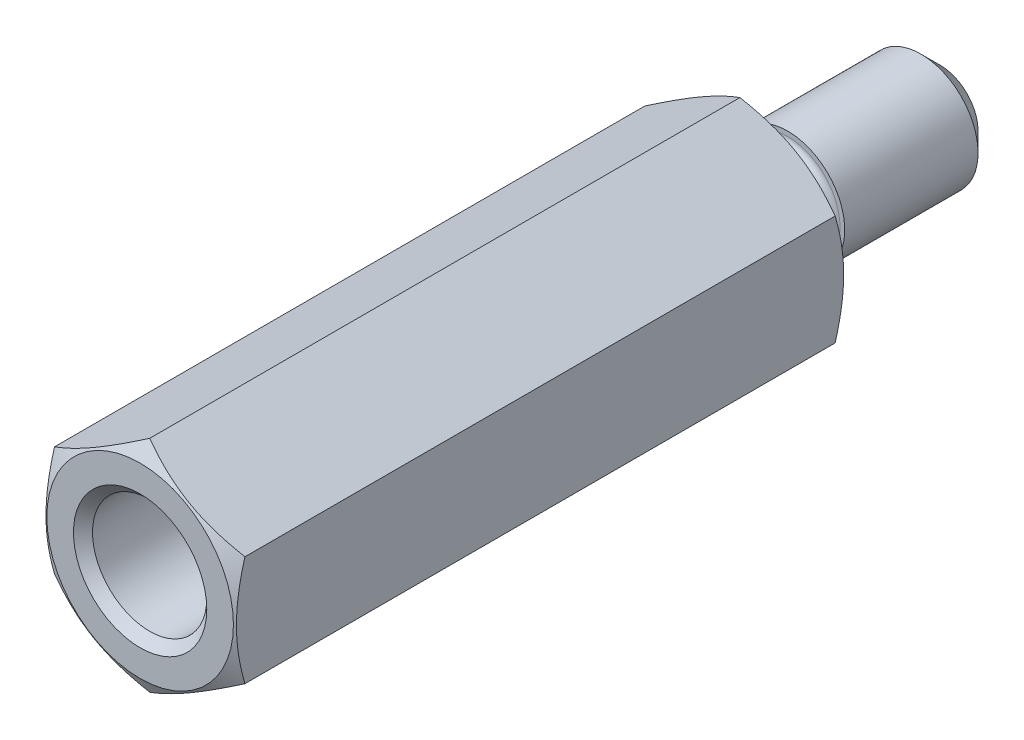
ISO-10303-21;
HEADER;
FILE_DESCRIPTION(('STEP AP214'),'2;1');
FILE_NAME('part.step','',(''),(''),'','','');
FILE_SCHEMA(('AUTOMOTIVE_DESIGN { 1 0 10303 214 1 1 1 1 }'));
ENDSEC;
DATA;
#1=APPLICATION_CONTEXT('core data for automotive mechanical design processes');
#2=APPLICATION_PROTOCOL_DEFINITION('international standard','automotive_design',2000,#1);
#3=PRODUCT_CONTEXT('',#1,'mechanical');
#4=PRODUCT('Part','Part','',(#3));
#5=PRODUCT_RELATED_PRODUCT_CATEGORY('part','',(#4));
#6=PRODUCT_DEFINITION_FORMATION('','',#4);
#7=PRODUCT_DEFINITION_CONTEXT('part definition',#1,'design');
#8=PRODUCT_DEFINITION('design','',#6,#7);
#9=PRODUCT_DEFINITION_SHAPE('','',#8);
#10=(LENGTH_UNIT() NAMED_UNIT(*) SI_UNIT(.MILLI.,.METRE.));
#11=(NAMED_UNIT(*) PLANE_ANGLE_UNIT() SI_UNIT($,.RADIAN.));
#12=(NAMED_UNIT(*) SI_UNIT($,.STERADIAN.) SOLID_ANGLE_UNIT());
#13=UNCERTAINTY_MEASURE_WITH_UNIT(LENGTH_MEASURE(1.E-05),#10,'distance_accuracy_value','');
#14=(GEOMETRIC_REPRESENTATION_CONTEXT(3) GLOBAL_UNCERTAINTY_ASSIGNED_CONTEXT((#13)) GLOBAL_UNIT_ASSIGNED_CONTEXT((#10,
#11,#12)) REPRESENTATION_CONTEXT('',''));
#15=CARTESIAN_POINT('',(0.,0.,0.));
#16=DIRECTION('',(0.,0.,1.));
#17=DIRECTION('',(1.,0.,0.));
#18=AXIS2_PLACEMENT_3D('',#15,#16,#17);
#19=CARTESIAN_POINT('',(0.,-5.77350269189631,0.));
#20=DIRECTION('',(0.,0.,-1.));
#21=DIRECTION('',(-1.,0.,0.));
#22=AXIS2_PLACEMENT_3D('',#19,#20,#21);
#23=PLANE('',#22);
#24=CARTESIAN_POINT('',(0.,0.,0.));
#25=DIRECTION('',(0.,0.,-1.));
#26=DIRECTION('',(-1.,0.,0.));
#27=AXIS2_PLACEMENT_3D('',#24,#25,#26);
#28=CIRCLE('',#27,2.75);
#29=CARTESIAN_POINT('',(-2.75,0.,0.));
#30=VERTEX_POINT('',#29);
#31=EDGE_CURVE('E23',#30,#30,#28,.F.);
#32=ORIENTED_EDGE('',*,*,#31,.T.);
#33=EDGE_LOOP('',(#32));
#34=FACE_BOUND('',#33,.T.);
#35=CARTESIAN_POINT('',(0.,0.,0.));
#36=DIRECTION('',(0.,0.,-1.));
#37=DIRECTION('',(-1.,0.,0.));
#38=AXIS2_PLACEMENT_3D('',#35,#36,#37);
#39=CIRCLE('',#38,4.9);
#40=CARTESIAN_POINT('',(-4.9,0.,0.));
#41=VERTEX_POINT('',#40);
#42=EDGE_CURVE('E73',#41,#41,#39,.T.);
#43=ORIENTED_EDGE('',*,*,#42,.T.);
#44=EDGE_LOOP('',(#43));
#45=FACE_BOUND('',#44,.T.);
#46=ADVANCED_FACE('F14',(#34,#45),#23,.T.);
#47=CARTESIAN_POINT('',(0.,0.,-10.));
#48=DIRECTION('',(0.,0.,1.));
#49=DIRECTION('',(1.,0.,0.));
#50=AXIS2_PLACEMENT_3D('',#47,#48,#49);
#51=CYLINDRICAL_SURFACE('',#50,3.);
#52=CARTESIAN_POINT('',(0.,0.,-2.));
#53=DIRECTION('',(0.,0.,-1.));
#54=DIRECTION('',(-1.,0.,0.));
#55=AXIS2_PLACEMENT_3D('',#52,#53,#54);
#56=CIRCLE('',#55,3.);
#57=CARTESIAN_POINT('',(-3.,0.,-2.));
#58=VERTEX_POINT('',#57);
#59=EDGE_CURVE('E233',#58,#58,#56,.T.);
#60=ORIENTED_EDGE('',*,*,#59,.T.);
#61=EDGE_LOOP('',(#60));
#62=FACE_BOUND('',#61,.T.);
#63=CARTESIAN_POINT('',(0.,0.,-9.));
#64=DIRECTION('',(0.,0.,-1.));
#65=DIRECTION('',(-1.,0.,0.));
#66=AXIS2_PLACEMENT_3D('',#63,#64,#65);
#67=CIRCLE('',#66,3.);
#68=CARTESIAN_POINT('',(-3.,0.,-9.));
#69=VERTEX_POINT('',#68);
#70=EDGE_CURVE('E85',#69,#69,#67,.F.);
#71=ORIENTED_EDGE('',*,*,#70,.T.);
#72=EDGE_LOOP('',(#71));
#73=FACE_BOUND('',#72,.T.);
#74=ADVANCED_FACE('F209',(#62,#73),#51,.T.);
#75=CARTESIAN_POINT('',(0.,0.,-10.));
#76=DIRECTION('',(0.,0.,-1.));
#77=DIRECTION('',(-1.,0.,0.));
#78=AXIS2_PLACEMENT_3D('',#75,#76,#77);
#79=PLANE('',#78);
#80=CARTESIAN_POINT('',(0.,0.,-10.));
#81=DIRECTION('',(0.,0.,-1.));
#82=DIRECTION('',(-1.,0.,0.));
#83=AXIS2_PLACEMENT_3D('',#80,#81,#82);
#84=CIRCLE('',#83,2.);
#85=CARTESIAN_POINT('',(-2.,0.,-10.));
#86=VERTEX_POINT('',#85);
#87=EDGE_CURVE('E82',#86,#86,#84,.T.);
#88=ORIENTED_EDGE('',*,*,#87,.T.);
#89=EDGE_LOOP('',(#88));
#90=FACE_BOUND('',#89,.T.);
#91=ADVANCED_FACE('F213',(#90),#79,.T.);
#92=CARTESIAN_POINT('',(0.,0.,-10.));
#93=DIRECTION('',(0.,0.,1.));
#94=DIRECTION('',(1.,0.,0.));
#95=AXIS2_PLACEMENT_3D('',#92,#93,#94);
#96=CONICAL_SURFACE('',#95,2.,0.785398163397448);
#97=ORIENTED_EDGE('',*,*,#70,.F.);
#98=EDGE_LOOP('',(#97));
#99=FACE_BOUND('',#98,.T.);
#100=ORIENTED_EDGE('',*,*,#87,.F.);
#101=EDGE_LOOP('',(#100));
#102=FACE_BOUND('',#101,.T.);
#103=ADVANCED_FACE('F216',(#99,#102),#96,.T.);
#104=CARTESIAN_POINT('',(0.,0.,-2.));
#105=DIRECTION('',(0.,0.,-1.));
#106=DIRECTION('',(-1.,0.,0.));
#107=AXIS2_PLACEMENT_3D('',#104,#105,#106);
#108=PLANE('',#107);
#109=CARTESIAN_POINT('',(0.,0.,-2.));
#110=DIRECTION('',(0.,0.,-1.));
#111=DIRECTION('',(-1.,0.,0.));
#112=AXIS2_PLACEMENT_3D('',#109,#110,#111);
#113=CIRCLE('',#112,2.75);
#114=CARTESIAN_POINT('',(-2.75,0.,-2.));
#115=VERTEX_POINT('',#114);
#116=EDGE_CURVE('E93',#115,#115,#113,.T.);
#117=ORIENTED_EDGE('',*,*,#116,.T.);
#118=EDGE_LOOP('',(#117));
#119=FACE_BOUND('',#118,.T.);
#120=ORIENTED_EDGE('',*,*,#59,.F.);
#121=EDGE_LOOP('',(#120));
#122=FACE_BOUND('',#121,.T.);
#123=ADVANCED_FACE('F218',(#119,#122),#108,.F.);
#124=CARTESIAN_POINT('',(0.,0.,-2.));
#125=DIRECTION('',(0.,0.,1.));
#126=DIRECTION('',(1.,0.,0.));
#127=AXIS2_PLACEMENT_3D('',#124,#125,#126);
#128=CYLINDRICAL_SURFACE('',#127,2.35);
#129=CARTESIAN_POINT('',(0.,0.,-1.6));
#130=DIRECTION('',(0.,0.,-1.));
#131=DIRECTION('',(-1.,0.,0.));
#132=AXIS2_PLACEMENT_3D('',#129,#130,#131);
#133=CIRCLE('',#132,2.35);
#134=CARTESIAN_POINT('',(-2.35,0.,-1.6));
#135=VERTEX_POINT('',#134);
#136=EDGE_CURVE('E99',#135,#135,#133,.F.);
#137=ORIENTED_EDGE('',*,*,#136,.T.);
#138=EDGE_LOOP('',(#137));
#139=FACE_BOUND('',#138,.T.);
#140=CARTESIAN_POINT('',(0.,0.,-0.4));
#141=DIRECTION('',(0.,0.,-1.));
#142=DIRECTION('',(-1.,0.,0.));
#143=AXIS2_PLACEMENT_3D('',#140,#141,#142);
#144=CIRCLE('',#143,2.35);
#145=CARTESIAN_POINT('',(-2.35,0.,-0.4));
#146=VERTEX_POINT('',#145);
#147=EDGE_CURVE('E96',#146,#146,#144,.T.);
#148=ORIENTED_EDGE('',*,*,#147,.T.);
#149=EDGE_LOOP('',(#148));
#150=FACE_BOUND('',#149,.T.);
#151=ADVANCED_FACE('F121',(#139,#150),#128,.T.);
#152=CARTESIAN_POINT('',(0.,0.,-1.6));
#153=DIRECTION('',(0.,0.,-1.));
#154=DIRECTION('',(-1.,0.,0.));
#155=AXIS2_PLACEMENT_3D('',#152,#153,#154);
#156=TOROIDAL_SURFACE('',#155,2.75,0.4);
#157=ORIENTED_EDGE('',*,*,#136,.F.);
#158=EDGE_LOOP('',(#157));
#159=FACE_BOUND('',#158,.T.);
#160=ORIENTED_EDGE('',*,*,#116,.F.);
#161=EDGE_LOOP('',(#160));
#162=FACE_BOUND('',#161,.T.);
#163=ADVANCED_FACE('F226',(#159,#162),#156,.F.);
#164=CARTESIAN_POINT('',(0.,0.,-0.4));
#165=DIRECTION('',(0.,0.,-1.));
#166=DIRECTION('',(-1.,0.,0.));
#167=AXIS2_PLACEMENT_3D('',#164,#165,#166);
#168=TOROIDAL_SURFACE('',#167,2.75,0.4);
#169=ORIENTED_EDGE('',*,*,#31,.F.);
#170=EDGE_LOOP('',(#169));
#171=FACE_BOUND('',#170,.T.);
#172=ORIENTED_EDGE('',*,*,#147,.F.);
#173=EDGE_LOOP('',(#172));
#174=FACE_BOUND('',#173,.T.);
#175=ADVANCED_FACE('F16',(#171,#174),#168,.F.);
#176=CARTESIAN_POINT('',(0.,0.,0.));
#177=DIRECTION('',(0.,0.,1.));
#178=DIRECTION('',(-1.,0.,0.));
#179=AXIS2_PLACEMENT_3D('',#176,#177,#178);
#180=CONICAL_SURFACE('',#179,4.9,1.0471975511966);
#181=ORIENTED_EDGE('',*,*,#42,.F.);
#182=EDGE_LOOP('',(#181));
#183=FACE_BOUND('',#182,.T.);
#184=CARTESIAN_POINT('',(5.,-28.4243501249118,13.8337533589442));
#185=CARTESIAN_POINT('',(4.99999999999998,-27.537544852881,13.3295392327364));
#186=CARTESIAN_POINT('',(4.99999999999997,-26.6504677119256,12.825801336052));
#187=CARTESIAN_POINT('',(4.99999999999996,-24.8744835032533,11.8191944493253));
#188=CARTESIAN_POINT('',(4.99999999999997,-23.9855755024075,11.3163271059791));
#189=CARTESIAN_POINT('',(4.99999999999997,-22.1863571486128,10.3010709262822));
#190=CARTESIAN_POINT('',(4.99999999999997,-21.2760215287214,9.78872684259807));
#191=CARTESIAN_POINT('',(4.99999999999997,-19.4547568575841,8.76753594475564));
#192=CARTESIAN_POINT('',(4.99999999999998,-18.5438296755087,8.25868580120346));
#193=CARTESIAN_POINT('',(4.99999999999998,-17.0037481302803,7.40325740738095));
#194=CARTESIAN_POINT('',(4.99999999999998,-16.3752376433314,7.05552084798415));
#195=CARTESIAN_POINT('',(4.99999999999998,-15.1166280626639,6.36293820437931));
#196=CARTESIAN_POINT('',(4.99999999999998,-14.4865289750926,6.01809210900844));
#197=CARTESIAN_POINT('',(4.99999999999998,-13.2215425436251,5.33110139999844));
#198=CARTESIAN_POINT('',(4.99999999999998,-12.5866461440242,4.98897341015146));
#199=CARTESIAN_POINT('',(4.99999999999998,-11.6319360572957,4.48049903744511));
#200=CARTESIAN_POINT('',(4.99999999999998,-11.3133630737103,4.31182399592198));
#201=CARTESIAN_POINT('',(4.99999999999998,-10.6751911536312,3.97642742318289));
#202=CARTESIAN_POINT('',(4.99999999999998,-10.3555922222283,3.809705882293));
#203=CARTESIAN_POINT('',(4.99999999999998,-9.72072526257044,3.48163105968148));
#204=CARTESIAN_POINT('',(4.99999999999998,-9.40547942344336,3.32023489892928));
#205=CARTESIAN_POINT('',(4.99999999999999,-8.77342887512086,3.00050127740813));
#206=CARTESIAN_POINT('',(4.99999999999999,-8.45662413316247,2.84216388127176));
#207=CARTESIAN_POINT('',(4.99999999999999,-7.82055467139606,2.52925722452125));
#208=CARTESIAN_POINT('',(4.99999999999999,-7.5012869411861,2.37469406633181));
#209=CARTESIAN_POINT('',(4.99999999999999,-6.86021433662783,2.07094785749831));
#210=CARTESIAN_POINT('',(4.99999999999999,-6.53840961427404,1.92176448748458));
#211=CARTESIAN_POINT('',(4.99999999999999,-5.8938983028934,1.63183101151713));
#212=CARTESIAN_POINT('',(4.99999999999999,-5.57121648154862,1.49102615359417));
#213=CARTESIAN_POINT('',(4.99999999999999,-4.92148572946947,1.21946954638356));
#214=CARTESIAN_POINT('',(4.99999999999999,-4.59443548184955,1.08872091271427));
#215=CARTESIAN_POINT('',(4.99999999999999,-3.93578303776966,0.841936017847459));
#216=CARTESIAN_POINT('',(4.99999999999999,-3.60419550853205,0.725861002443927));
#217=CARTESIAN_POINT('',(5.,-2.93457310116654,0.514306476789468));
#218=CARTESIAN_POINT('',(5.00000000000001,-2.59654394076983,0.418809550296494));
#219=CARTESIAN_POINT('',(5.,-2.19397553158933,0.323254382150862));
#220=CARTESIAN_POINT('',(4.99999999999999,-2.132708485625,0.30920152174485));
#221=CARTESIAN_POINT('',(4.99999999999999,-2.0099500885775,0.28207567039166));
#222=CARTESIAN_POINT('',(4.99999999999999,-1.94845871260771,0.269002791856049));
#223=CARTESIAN_POINT('',(4.99999999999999,-1.76363164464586,0.231327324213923));
#224=CARTESIAN_POINT('',(4.99999999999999,-1.63997489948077,0.208275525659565));
#225=CARTESIAN_POINT('',(4.99999999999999,-1.39195751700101,0.166729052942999));
#226=CARTESIAN_POINT('',(4.99999999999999,-1.26759724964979,0.148232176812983));
#227=CARTESIAN_POINT('',(4.99999999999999,-1.01824571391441,0.116152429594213));
#228=CARTESIAN_POINT('',(5.,-0.893254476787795,0.102569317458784));
#229=CARTESIAN_POINT('',(5.,-0.645529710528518,0.0808547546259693));
#230=CARTESIAN_POINT('',(5.,-0.52280604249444,0.0726114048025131));
#231=CARTESIAN_POINT('',(5.,-0.277121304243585,0.0613010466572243));
#232=CARTESIAN_POINT('',(5.,-0.154160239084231,0.0582339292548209));
#233=CARTESIAN_POINT('',(5.,0.0918501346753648,0.0573482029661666));
#234=CARTESIAN_POINT('',(5.,0.21489945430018,0.0595325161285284));
#235=CARTESIAN_POINT('',(5.,0.460797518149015,0.0691024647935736));
#236=CARTESIAN_POINT('',(5.,0.583646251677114,0.076488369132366));
#237=CARTESIAN_POINT('',(5.,0.878328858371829,0.100288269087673));
#238=CARTESIAN_POINT('',(5.,1.04997010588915,0.119139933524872));
#239=CARTESIAN_POINT('',(5.,1.39199184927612,0.165979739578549));
#240=CARTESIAN_POINT('',(5.,1.56237218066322,0.193969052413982));
#241=CARTESIAN_POINT('',(5.,2.0712921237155,0.290142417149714));
#242=CARTESIAN_POINT('',(5.,2.40755728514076,0.370527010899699));
#243=CARTESIAN_POINT('',(5.,2.91135125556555,0.510317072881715));
#244=CARTESIAN_POINT('',(5.,3.08146708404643,0.560933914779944));
#245=CARTESIAN_POINT('',(5.,3.42004199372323,0.667484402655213));
#246=CARTESIAN_POINT('',(5.,3.58850105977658,0.72341809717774));
#247=CARTESIAN_POINT('',(5.,3.92384798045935,0.839707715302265));
#248=CARTESIAN_POINT('',(5.,4.09073602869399,0.900063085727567));
#249=CARTESIAN_POINT('',(5.,4.42311823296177,1.02446572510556));
#250=CARTESIAN_POINT('',(5.,4.58861244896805,1.08851283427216));
#251=CARTESIAN_POINT('',(5.,4.94891306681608,1.23183982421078));
#252=CARTESIAN_POINT('',(5.,5.14347061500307,1.3117437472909));
#253=CARTESIAN_POINT('',(5.,5.53110433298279,1.47507510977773));
#254=CARTESIAN_POINT('',(5.,5.7241804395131,1.55850269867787));
#255=CARTESIAN_POINT('',(5.,6.30157867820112,1.81310324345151));
#256=CARTESIAN_POINT('',(5.,6.68400704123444,1.98856812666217));
#257=CARTESIAN_POINT('',(5.00000000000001,7.44542035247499,2.34740942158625));
#258=CARTESIAN_POINT('',(5.00000000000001,7.82440274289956,2.53079120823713));
#259=CARTESIAN_POINT('',(5.00000000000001,8.57959325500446,2.90308138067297));
#260=CARTESIAN_POINT('',(5.00000000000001,8.95580162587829,3.09198926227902));
#261=CARTESIAN_POINT('',(5.00000000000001,9.70700934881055,3.47427785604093));
#262=CARTESIAN_POINT('',(5.00000000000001,10.0820040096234,3.667667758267));
#263=CARTESIAN_POINT('',(5.00000000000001,10.8304158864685,4.05748938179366));
#264=CARTESIAN_POINT('',(5.00000000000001,11.2038330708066,4.25392116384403));
#265=CARTESIAN_POINT('',(5.00000000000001,11.9492850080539,4.64903147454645));
#266=CARTESIAN_POINT('',(5.00000000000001,12.3213202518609,4.84770907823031));
#267=CARTESIAN_POINT('',(5.00000000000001,13.0644144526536,5.24688268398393));
#268=CARTESIAN_POINT('',(5.00000000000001,13.4354734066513,5.44737869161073));
#269=CARTESIAN_POINT('',(5.00000000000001,14.4353604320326,5.9901577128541));
#270=CARTESIAN_POINT('',(5.00000000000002,15.0634547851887,6.33379185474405));
#271=CARTESIAN_POINT('',(5.00000000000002,16.3181238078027,7.02398888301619));
#272=CARTESIAN_POINT('',(5.00000000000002,16.9446982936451,7.37055210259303));
#273=CARTESIAN_POINT('',(5.00000000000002,18.1940881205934,8.06433912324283));
#274=CARTESIAN_POINT('',(5.00000000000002,18.8169082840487,8.41155424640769));
#275=CARTESIAN_POINT('',(5.00000000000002,20.0615795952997,9.10753415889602));
#276=CARTESIAN_POINT('',(5.00000000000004,20.6834308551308,9.45629874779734));
#277=CARTESIAN_POINT('',(5.00000000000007,21.3049701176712,9.8056153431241));
#278=B_SPLINE_CURVE_WITH_KNOTS('',3,(#184,#185,#186,#187,#188,#189,#190,#191,#192,#193,#194,
#195,#196,#197,#198,#199,#200,#201,#202,#203,#204,#205,#206,#207,#208,#209,#210,#211,#212,#213,
#214,#215,#216,#217,#218,#219,#220,#221,#222,#223,#224,#225,#226,#227,#228,#229,#230,#231,#232,
#233,#234,#235,#236,#237,#238,#239,#240,#241,#242,#243,#244,#245,#246,#247,#248,#249,#250,#251,
#252,#253,#254,#255,#256,#257,#258,#259,#260,#261,#262,#263,#264,#265,#266,#267,#268,#269,#270,
#271,#272,#273,#274,#275,#276,#277),.UNSPECIFIED.,.F.,.F.,(4,2,2,2,2,2,2,2,2,2,2,2,2,2,2,2,2,2,
2,2,2,2,2,2,2,2,2,2,2,2,2,2,2,2,2,2,2,2,2,2,2,2,2,2,2,2,4),(0.,3.06037699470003,
6.12424507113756,9.25806796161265,12.3883070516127,14.5431832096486,16.6980510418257,
18.86165645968,19.9430671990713,21.024472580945,22.0869371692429,23.1494241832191,
24.2135284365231,25.2775694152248,26.3336482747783,27.3900530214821,28.4436066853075,
29.4962651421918,29.6848334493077,29.8734233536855,30.2507014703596,30.6277968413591,
31.0048737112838,31.3737684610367,31.7426554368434,32.1117477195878,32.48085907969,
32.9985886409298,33.5163845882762,34.5521366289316,35.0845501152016,35.6169684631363,
36.1493203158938,36.6816491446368,37.3125848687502,37.9435473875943,39.2056785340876,
40.4686804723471,41.7315675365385,42.9973249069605,44.2631075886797,45.5283866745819,
46.7936696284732,48.9415126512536,51.0896033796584,53.228799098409,55.3677257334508),.UNSPECIFIED.);
#279=CARTESIAN_POINT('',(5.,2.88675134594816,0.504317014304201));
#280=VERTEX_POINT('',#279);
#281=CARTESIAN_POINT('',(5.,-2.88675134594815,0.504317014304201));
#282=VERTEX_POINT('',#281);
#283=EDGE_CURVE('E30',#280,#282,#278,.F.);
#284=ORIENTED_EDGE('',*,*,#283,.T.);
#285=CARTESIAN_POINT('',(5.0002,-2.88663587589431,0.504383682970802));
#286=CARTESIAN_POINT('',(4.78046540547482,-3.0134997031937,0.431121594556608));
#287=CARTESIAN_POINT('',(4.55885141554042,-3.14144859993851,0.364486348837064));
#288=CARTESIAN_POINT('',(4.11178600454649,-3.39956193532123,0.248174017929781));
#289=CARTESIAN_POINT('',(3.88632664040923,-3.52973095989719,0.19853807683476));
#290=CARTESIAN_POINT('',(3.4381676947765,-3.78847564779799,0.121286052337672));
#291=CARTESIAN_POINT('',(3.21553790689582,-3.91701101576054,0.0931554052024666));
#292=CARTESIAN_POINT('',(2.88081009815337,-4.11026620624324,0.0679299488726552));
#293=CARTESIAN_POINT('',(2.76915780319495,-4.17472868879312,0.0623484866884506));
#294=CARTESIAN_POINT('',(2.54575002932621,-4.3037132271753,0.0569372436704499));
#295=CARTESIAN_POINT('',(2.43399455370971,-4.36823528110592,0.0571072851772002));
#296=CARTESIAN_POINT('',(2.12781576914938,-4.54500768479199,0.0654886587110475));
#297=CARTESIAN_POINT('',(1.93349391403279,-4.65719946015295,0.0795647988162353));
#298=CARTESIAN_POINT('',(1.54613989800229,-4.88083840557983,0.124200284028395));
#299=CARTESIAN_POINT('',(1.35310909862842,-4.99228478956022,0.15477488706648));
#300=CARTESIAN_POINT('',(0.96497465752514,-5.21637431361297,0.231203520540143));
#301=CARTESIAN_POINT('',(0.769920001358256,-5.32898917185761,0.277381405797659));
#302=CARTESIAN_POINT('',(0.382719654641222,-5.55253939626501,0.38218682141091));
#303=CARTESIAN_POINT('',(0.190569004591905,-5.66347762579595,0.440789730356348));
#304=CARTESIAN_POINT('',(-0.000199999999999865,-5.77361816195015,0.504383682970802));
#305=B_SPLINE_CURVE_WITH_KNOTS('',3,(#285,#286,#287,#288,#289,#290,#291,#292,#293,#294,#295,
#296,#297,#298,#299,#300,#301,#302,#303,#304),.UNSPECIFIED.,.F.,.F.,(4,2,2,2,2,2,2,2,2,4),(0.,
0.792555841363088,1.58701660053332,2.36181537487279,2.74884076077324,3.13585419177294,
3.80962362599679,4.4840172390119,5.17336882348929,5.86136694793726),.UNSPECIFIED.);
#306=CARTESIAN_POINT('',(0.,-5.77350269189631,0.504317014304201));
#307=VERTEX_POINT('',#306);
#308=EDGE_CURVE('E67',#282,#307,#305,.T.);
#309=ORIENTED_EDGE('',*,*,#308,.T.);
#310=CARTESIAN_POINT('',(0.0002,-5.77361816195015,0.504383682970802));
#311=CARTESIAN_POINT('',(-0.219534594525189,-5.64675433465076,0.431121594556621));
#312=CARTESIAN_POINT('',(-0.441148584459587,-5.51880543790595,0.364486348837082));
#313=CARTESIAN_POINT('',(-0.888213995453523,-5.26069210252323,0.248174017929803));
#314=CARTESIAN_POINT('',(-1.11367335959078,-5.13052307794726,0.19853807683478));
#315=CARTESIAN_POINT('',(-1.56183230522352,-4.87177839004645,0.121286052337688));
#316=CARTESIAN_POINT('',(-1.78446209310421,-4.74324302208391,0.0931554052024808));
#317=CARTESIAN_POINT('',(-2.11918990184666,-4.5499878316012,0.0679299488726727));
#318=CARTESIAN_POINT('',(-2.23084219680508,-4.48552534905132,0.0623484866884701));
#319=CARTESIAN_POINT('',(-2.45424997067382,-4.35654081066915,0.0569372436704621));
#320=CARTESIAN_POINT('',(-2.56600544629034,-4.29201875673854,0.0571072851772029));
#321=CARTESIAN_POINT('',(-2.87218423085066,-4.11524635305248,0.0654886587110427));
#322=CARTESIAN_POINT('',(-3.06650608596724,-4.0030545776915,0.0795647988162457));
#323=CARTESIAN_POINT('',(-3.45386010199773,-3.77941563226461,0.124200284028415));
#324=CARTESIAN_POINT('',(-3.64689090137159,-3.66796924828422,0.154774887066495));
#325=CARTESIAN_POINT('',(-4.03502534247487,-3.44387972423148,0.231203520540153));
#326=CARTESIAN_POINT('',(-4.23007999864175,-3.33126486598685,0.277381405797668));
#327=CARTESIAN_POINT('',(-4.61728034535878,-3.10771464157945,0.382186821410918));
#328=CARTESIAN_POINT('',(-4.80943099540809,-2.99677641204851,0.440789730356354));
#329=CARTESIAN_POINT('',(-5.0002,-2.88663587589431,0.504383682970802));
#330=B_SPLINE_CURVE_WITH_KNOTS('',3,(#310,#311,#312,#313,#314,#315,#316,#317,#318,#319,#320,
#321,#322,#323,#324,#325,#326,#327,#328,#329),.UNSPECIFIED.,.F.,.F.,(4,2,2,2,2,2,2,2,2,4),(0.,
0.792555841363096,1.58701660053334,2.36181537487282,2.74884076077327,3.13585419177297,
3.80962362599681,4.48401723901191,5.1733688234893,5.86136694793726),.UNSPECIFIED.);
#331=CARTESIAN_POINT('',(-5.,-2.88675134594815,0.504317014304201));
#332=VERTEX_POINT('',#331);
#333=EDGE_CURVE('E69',#307,#332,#330,.T.);
#334=ORIENTED_EDGE('',*,*,#333,.T.);
#335=CARTESIAN_POINT('',(-5.,-28.4243501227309,13.8337533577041));
#336=CARTESIAN_POINT('',(-5.,-27.5375448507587,13.3295392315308));
#337=CARTESIAN_POINT('',(-5.,-26.650467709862,12.825801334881));
#338=CARTESIAN_POINT('',(-5.,-24.874483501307,11.8191944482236));
#339=CARTESIAN_POINT('',(-5.,-23.9855755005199,11.3163271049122));
#340=CARTESIAN_POINT('',(-5.,-22.1863571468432,10.3010709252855));
#341=CARTESIAN_POINT('',(-5.,-21.2760215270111,9.78872684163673));
#342=CARTESIAN_POINT('',(-5.,-19.454756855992,8.76753594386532));
#343=CARTESIAN_POINT('',(-5.,-18.5438296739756,8.25868580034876));
#344=CARTESIAN_POINT('',(-5.,-17.0037481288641,7.40325740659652));
#345=CARTESIAN_POINT('',(-5.,-16.3752376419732,7.05552084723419));
#346=CARTESIAN_POINT('',(-5.,-15.1166280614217,6.36293820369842));
#347=CARTESIAN_POINT('',(-5.,-14.4865289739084,6.01809210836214));
#348=CARTESIAN_POINT('',(-5.,-13.2215425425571,5.33110139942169));
#349=CARTESIAN_POINT('',(-5.,-12.5866461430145,4.98897340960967));
#350=CARTESIAN_POINT('',(-5.,-11.6319360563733,4.48049903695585));
#351=CARTESIAN_POINT('',(-5.,-11.3133630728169,4.31182399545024));
#352=CARTESIAN_POINT('',(-5.,-10.6751911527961,3.97642742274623));
#353=CARTESIAN_POINT('',(-5.,-10.3555922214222,3.80970588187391));
#354=CARTESIAN_POINT('',(-5.,-9.72072526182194,3.4816310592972));
#355=CARTESIAN_POINT('',(-5.,-9.40547942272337,3.32023489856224));
#356=CARTESIAN_POINT('',(-5.,-8.77342887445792,3.0005012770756));
#357=CARTESIAN_POINT('',(-5.,-8.45662413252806,2.84216388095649));
#358=CARTESIAN_POINT('',(-5.,-7.82055467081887,2.52925722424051));
#359=CARTESIAN_POINT('',(-5.,-7.50128694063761,2.37469406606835));
#360=CARTESIAN_POINT('',(-5.,-6.86021433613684,2.07094785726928));
#361=CARTESIAN_POINT('',(-5.,-6.53840961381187,1.92176448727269));
#362=CARTESIAN_POINT('',(-5.,-5.89389830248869,1.63183101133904));
#363=CARTESIAN_POINT('',(-5.,-5.57121648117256,1.49102615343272));
#364=CARTESIAN_POINT('',(-5.,-4.92148572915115,1.2194695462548));
#365=CARTESIAN_POINT('',(-5.,-4.59443548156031,1.08872091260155));
#366=CARTESIAN_POINT('',(-5.,-3.9357830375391,0.84193601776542));
#367=CARTESIAN_POINT('',(-5.,-3.60419550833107,0.725861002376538));
#368=CARTESIAN_POINT('',(-5.,-2.93457310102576,0.51430647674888));
#369=CARTESIAN_POINT('',(-5.,-2.59654394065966,0.418809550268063));
#370=CARTESIAN_POINT('',(-5.,-2.1939755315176,0.323254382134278));
#371=CARTESIAN_POINT('',(-5.,-2.13270848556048,0.30920152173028));
#372=CARTESIAN_POINT('',(-5.,-2.00995008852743,0.282075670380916));
#373=CARTESIAN_POINT('',(-5.,-1.9484587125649,0.269002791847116));
#374=CARTESIAN_POINT('',(-5.,-1.76363164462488,0.231327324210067));
#375=CARTESIAN_POINT('',(-5.,-1.63997489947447,0.208275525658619));
#376=CARTESIAN_POINT('',(-5.,-1.39195751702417,0.166729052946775));
#377=CARTESIAN_POINT('',(-5.,-1.26759724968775,0.148232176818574));
#378=CARTESIAN_POINT('',(-5.,-1.01824571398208,0.116152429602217));
#379=CARTESIAN_POINT('',(-5.,-0.893254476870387,0.102569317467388));
#380=CARTESIAN_POINT('',(-5.,-0.645529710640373,0.0808547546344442));
#381=CARTESIAN_POINT('',(-5.,-0.522806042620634,0.0726114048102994));
#382=CARTESIAN_POINT('',(-5.,-0.277121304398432,0.0613010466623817));
#383=CARTESIAN_POINT('',(-5.,-0.154160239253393,0.0582339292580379));
#384=CARTESIAN_POINT('',(-5.,0.0918501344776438,0.0573482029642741));
#385=CARTESIAN_POINT('',(-5.,0.214899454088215,0.059532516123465));
#386=CARTESIAN_POINT('',(-5.,0.460797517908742,0.0691024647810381));
#387=CARTESIAN_POINT('',(-5.,0.583646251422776,0.0764883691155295));
#388=CARTESIAN_POINT('',(-5.,0.878328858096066,0.100288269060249));
#389=CARTESIAN_POINT('',(-5.,1.04997010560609,0.119139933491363));
#390=CARTESIAN_POINT('',(-5.,1.39199184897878,0.165979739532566));
#391=CARTESIAN_POINT('',(-5.,1.56237218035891,0.19396905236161));
#392=CARTESIAN_POINT('',(-5.,2.07129212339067,0.290142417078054));
#393=CARTESIAN_POINT('',(-5.,2.40755728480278,0.370527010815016));
#394=CARTESIAN_POINT('',(-5.,2.91135125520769,0.510317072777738));
#395=CARTESIAN_POINT('',(-5.,3.08146708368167,0.560933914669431));
#396=CARTESIAN_POINT('',(-5.,3.42004199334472,0.667484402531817));
#397=CARTESIAN_POINT('',(-5.,3.58850105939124,0.723418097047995));
#398=CARTESIAN_POINT('',(-5.,3.92384798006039,0.839707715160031));
#399=CARTESIAN_POINT('',(-5.,4.09073602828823,0.900063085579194));
#400=CARTESIAN_POINT('',(-5.,4.42311823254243,1.02446572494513));
#401=CARTESIAN_POINT('',(-5.,4.58861244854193,1.0885128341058));
#402=CARTESIAN_POINT('',(-5.,4.94891306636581,1.23183982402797));
#403=CARTESIAN_POINT('',(-5.,5.14347061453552,1.31174374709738));
#404=CARTESIAN_POINT('',(-5.,5.53110433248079,1.47507510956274));
#405=CARTESIAN_POINT('',(-5.,5.72418043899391,1.55850269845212));
#406=CARTESIAN_POINT('',(-5.,6.30157867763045,1.81310324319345));
#407=CARTESIAN_POINT('',(-5.,6.68400704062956,1.98856812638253));
#408=CARTESIAN_POINT('',(-5.,7.44542035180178,2.34740942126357));
#409=CARTESIAN_POINT('',(-5.,7.8244027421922,2.53079120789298));
#410=CARTESIAN_POINT('',(-5.,8.57959325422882,2.90308138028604));
#411=CARTESIAN_POINT('',(-5.,8.95580162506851,3.09198926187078));
#412=CARTESIAN_POINT('',(-5.,9.70700934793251,3.47427785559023));
#413=CARTESIAN_POINT('',(-5.,10.0820040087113,3.66766775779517));
#414=CARTESIAN_POINT('',(-5.,10.830415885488,4.05748938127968));
#415=CARTESIAN_POINT('',(-5.,11.2038330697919,4.25392116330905));
#416=CARTESIAN_POINT('',(-5.,11.9492850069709,4.64903147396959));
#417=CARTESIAN_POINT('',(-5.,12.3213202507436,4.84770907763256));
#418=CARTESIAN_POINT('',(-5.,13.0644144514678,5.24688268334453));
#419=CARTESIAN_POINT('',(-5.,13.4354734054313,5.44737869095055));
#420=CARTESIAN_POINT('',(-5.,14.4353604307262,5.99015771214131));
#421=CARTESIAN_POINT('',(-5.,15.0634547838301,6.33379185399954));
#422=CARTESIAN_POINT('',(-5.,16.3181238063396,7.02398888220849));
#423=CARTESIAN_POINT('',(-5.,16.9446982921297,7.37055210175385));
#424=CARTESIAN_POINT('',(-5.,18.194088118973,8.06433912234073));
#425=CARTESIAN_POINT('',(-5.,18.8169082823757,8.41155424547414));
#426=CARTESIAN_POINT('',(-5.,20.0615795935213,9.10753415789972));
#427=CARTESIAN_POINT('',(-5.,20.6834308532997,9.45629874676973));
#428=CARTESIAN_POINT('',(-5.,21.3049701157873,9.80561534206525));
#429=B_SPLINE_CURVE_WITH_KNOTS('',3,(#335,#336,#337,#338,#339,#340,#341,#342,#343,#344,#345,
#346,#347,#348,#349,#350,#351,#352,#353,#354,#355,#356,#357,#358,#359,#360,#361,#362,#363,#364,
#365,#366,#367,#368,#369,#370,#371,#372,#373,#374,#375,#376,#377,#378,#379,#380,#381,#382,#383,
#384,#385,#386,#387,#388,#389,#390,#391,#392,#393,#394,#395,#396,#397,#398,#399,#400,#401,#402,
#403,#404,#405,#406,#407,#408,#409,#410,#411,#412,#413,#414,#415,#416,#417,#418,#419,#420,#421,
#422,#423,#424,#425,#426,#427,#428),.UNSPECIFIED.,.F.,.F.,(4,2,2,2,2,2,2,2,2,2,2,2,2,2,2,2,2,2,
2,2,2,2,2,2,2,2,2,2,2,2,2,2,2,2,2,2,2,2,2,2,2,2,2,2,2,2,4),(0.,3.06037699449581,
6.12424507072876,9.25806796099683,12.3883070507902,14.5431832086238,16.6980510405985,
18.8616564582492,19.9430671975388,21.0244725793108,22.086937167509,23.1494241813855,
24.2135284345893,25.277569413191,26.3336482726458,27.3900530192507,28.4436066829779,
29.4962651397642,29.6848334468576,29.873423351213,30.2507014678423,30.6277968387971,
31.0048737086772,31.3737684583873,31.7426554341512,32.1117477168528,32.4808590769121,
32.9985886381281,33.5163845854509,34.5521366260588,35.0845501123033,35.6169684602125,
36.1493203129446,36.6816491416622,37.3125848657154,37.9435473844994,39.2056785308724,
40.4686804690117,41.7315675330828,42.9973249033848,44.2631075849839,45.528386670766,
46.7936696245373,48.9415126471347,51.0896033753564,53.2287990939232,55.367725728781),.UNSPECIFIED.);
#430=CARTESIAN_POINT('',(-5.,2.88675134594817,0.504317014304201));
#431=VERTEX_POINT('',#430);
#432=EDGE_CURVE('E78',#332,#431,#429,.T.);
#433=ORIENTED_EDGE('',*,*,#432,.T.);
#434=CARTESIAN_POINT('',(-5.0002,2.88663587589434,0.504383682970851));
#435=CARTESIAN_POINT('',(-4.78046540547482,3.01349970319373,0.431121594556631));
#436=CARTESIAN_POINT('',(-4.55885141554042,3.14144859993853,0.364486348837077));
#437=CARTESIAN_POINT('',(-4.11178600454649,3.39956193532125,0.248174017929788));
#438=CARTESIAN_POINT('',(-3.88632664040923,3.52973095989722,0.198538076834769));
#439=CARTESIAN_POINT('',(-3.43816769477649,3.78847564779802,0.121286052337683));
#440=CARTESIAN_POINT('',(-3.21553790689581,3.91701101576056,0.0931554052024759));
#441=CARTESIAN_POINT('',(-2.88081009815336,4.11026620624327,0.0679299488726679));
#442=CARTESIAN_POINT('',(-2.76915780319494,4.17472868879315,0.0623484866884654));
#443=CARTESIAN_POINT('',(-2.54575002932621,4.30371322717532,0.0569372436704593));
#444=CARTESIAN_POINT('',(-2.4339945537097,4.36823528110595,0.0571072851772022));
#445=CARTESIAN_POINT('',(-2.12781576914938,4.54500768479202,0.0654886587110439));
#446=CARTESIAN_POINT('',(-1.93349391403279,4.65719946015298,0.0795647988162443));
#447=CARTESIAN_POINT('',(-1.54613989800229,4.88083840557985,0.124200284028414));
#448=CARTESIAN_POINT('',(-1.35310909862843,4.99228478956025,0.154774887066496));
#449=CARTESIAN_POINT('',(-0.964974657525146,5.216374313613,0.231203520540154));
#450=CARTESIAN_POINT('',(-0.769920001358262,5.32898917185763,0.277381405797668));
#451=CARTESIAN_POINT('',(-0.38271965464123,5.55253939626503,0.382186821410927));
#452=CARTESIAN_POINT('',(-0.190569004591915,5.66347762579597,0.440789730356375));
#453=CARTESIAN_POINT('',(0.000199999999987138,5.77361816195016,0.504383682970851));
#454=B_SPLINE_CURVE_WITH_KNOTS('',3,(#434,#435,#436,#437,#438,#439,#440,#441,#442,#443,#444,
#445,#446,#447,#448,#449,#450,#451,#452,#453),.UNSPECIFIED.,.F.,.F.,(4,2,2,2,2,2,2,2,2,4),(0.,
0.792555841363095,1.58701660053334,2.36181537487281,2.74884076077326,3.13585419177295,
3.8096236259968,4.4840172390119,5.1733688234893,5.86136694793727),.UNSPECIFIED.);
#455=CARTESIAN_POINT('',(0.,5.77350269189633,0.504317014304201));
#456=VERTEX_POINT('',#455);
#457=EDGE_CURVE('E175',#431,#456,#454,.T.);
#458=ORIENTED_EDGE('',*,*,#457,.T.);
#459=CARTESIAN_POINT('',(-0.000200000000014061,5.77361816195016,0.504383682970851));
#460=CARTESIAN_POINT('',(0.219534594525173,5.64675433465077,0.431121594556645));
#461=CARTESIAN_POINT('',(0.441148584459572,5.51880543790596,0.364486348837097));
#462=CARTESIAN_POINT('',(0.888213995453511,5.26069210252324,0.24817401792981));
#463=CARTESIAN_POINT('',(1.11367335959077,5.13052307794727,0.198538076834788));
#464=CARTESIAN_POINT('',(1.56183230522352,4.87177839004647,0.121286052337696));
#465=CARTESIAN_POINT('',(1.7844620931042,4.74324302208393,0.0931554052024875));
#466=CARTESIAN_POINT('',(2.11918990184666,4.54998783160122,0.0679299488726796));
#467=CARTESIAN_POINT('',(2.23084219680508,4.48552534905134,0.0623484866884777));
#468=CARTESIAN_POINT('',(2.45424997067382,4.35654081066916,0.0569372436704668));
#469=CARTESIAN_POINT('',(2.56600544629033,4.29201875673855,0.0571072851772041));
#470=CARTESIAN_POINT('',(2.87218423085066,4.11524635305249,0.0654886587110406));
#471=CARTESIAN_POINT('',(3.06650608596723,4.00305457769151,0.0795647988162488));
#472=CARTESIAN_POINT('',(3.45386010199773,3.77941563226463,0.124200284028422));
#473=CARTESIAN_POINT('',(3.64689090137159,3.66796924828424,0.1547748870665));
#474=CARTESIAN_POINT('',(4.03502534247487,3.4438797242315,0.231203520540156));
#475=CARTESIAN_POINT('',(4.23007999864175,3.33126486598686,0.277381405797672));
#476=CARTESIAN_POINT('',(4.61728034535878,3.10771464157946,0.382186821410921));
#477=CARTESIAN_POINT('',(4.80943099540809,2.99677641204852,0.440789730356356));
#478=CARTESIAN_POINT('',(5.0002,2.88663587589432,0.504383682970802));
#479=B_SPLINE_CURVE_WITH_KNOTS('',3,(#459,#460,#461,#462,#463,#464,#465,#466,#467,#468,#469,
#470,#471,#472,#473,#474,#475,#476,#477,#478),.UNSPECIFIED.,.F.,.F.,(4,2,2,2,2,2,2,2,2,4),(0.,
0.792555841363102,1.58701660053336,2.36181537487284,2.74884076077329,3.13585419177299,
3.80962362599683,4.48401723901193,5.17336882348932,5.86136694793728),.UNSPECIFIED.);
#480=EDGE_CURVE('E182',#456,#280,#479,.T.);
#481=ORIENTED_EDGE('',*,*,#480,.T.);
#482=EDGE_LOOP('',(#284,#309,#334,#433,#458,#481));
#483=FACE_BOUND('',#482,.T.);
#484=ADVANCED_FACE('F68',(#183,#483),#180,.T.);
#485=CARTESIAN_POINT('',(0.,-5.77350269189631,32.));
#486=DIRECTION('',(0.,0.,-1.));
#487=DIRECTION('',(-1.,0.,0.));
#488=AXIS2_PLACEMENT_3D('',#485,#486,#487);
#489=PLANE('',#488);
#490=CARTESIAN_POINT('',(0.,0.,32.));
#491=DIRECTION('',(0.,0.,1.));
#492=DIRECTION('',(1.,0.,0.));
#493=AXIS2_PLACEMENT_3D('',#490,#491,#492);
#494=CIRCLE('',#493,3.5);
#495=CARTESIAN_POINT('',(3.5,0.,32.));
#496=VERTEX_POINT('',#495);
#497=EDGE_CURVE('E406',#496,#496,#494,.T.);
#498=ORIENTED_EDGE('',*,*,#497,.F.);
#499=EDGE_LOOP('',(#498));
#500=FACE_BOUND('',#499,.T.);
#501=CARTESIAN_POINT('',(0.,0.,32.));
#502=DIRECTION('',(0.,0.,1.));
#503=DIRECTION('',(1.,0.,0.));
#504=AXIS2_PLACEMENT_3D('',#501,#502,#503);
#505=CIRCLE('',#504,4.9);
#506=CARTESIAN_POINT('',(4.9,0.,32.));
#507=VERTEX_POINT('',#506);
#508=EDGE_CURVE('E196',#507,#507,#505,.T.);
#509=ORIENTED_EDGE('',*,*,#508,.T.);
#510=EDGE_LOOP('',(#509));
#511=FACE_BOUND('',#510,.T.);
#512=ADVANCED_FACE('F117',(#500,#511),#489,.F.);
#513=CARTESIAN_POINT('',(0.,0.,32.));
#514=DIRECTION('',(0.,0.,-1.));
#515=DIRECTION('',(1.,0.,0.));
#516=AXIS2_PLACEMENT_3D('',#513,#514,#515);
#517=CONICAL_SURFACE('',#516,4.9,1.0471975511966);
#518=ORIENTED_EDGE('',*,*,#508,.F.);
#519=EDGE_LOOP('',(#518));
#520=FACE_BOUND('',#519,.T.);
#521=CARTESIAN_POINT('',(5.,-28.5555278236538,18.0916512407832));
#522=CARTESIAN_POINT('',(4.99999999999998,-27.6672147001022,18.5967929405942));
#523=CARTESIAN_POINT('',(4.99999999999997,-26.7786321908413,19.1014627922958));
#524=CARTESIAN_POINT('',(4.99999999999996,-24.9996699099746,20.1099358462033));
#525=CARTESIAN_POINT('',(4.99999999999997,-24.1092892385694,20.6137374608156));
#526=CARTESIAN_POINT('',(4.99999999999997,-22.307707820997,21.6305662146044));
#527=CARTESIAN_POINT('',(4.99999999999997,-21.3964828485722,22.1435504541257));
#528=CARTESIAN_POINT('',(4.99999999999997,-19.5734369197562,23.1660782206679));
#529=CARTESIAN_POINT('',(4.99999999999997,-18.661617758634,23.6756249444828));
#530=CARTESIAN_POINT('',(4.99999999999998,-17.1177350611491,24.5335842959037));
#531=CARTESIAN_POINT('',(4.99999999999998,-16.4863008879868,24.8831285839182));
#532=CARTESIAN_POINT('',(4.99999999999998,-15.2218582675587,25.5793545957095));
#533=CARTESIAN_POINT('',(4.99999999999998,-14.5888498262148,25.9260363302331));
#534=CARTESIAN_POINT('',(4.99999999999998,-13.3181164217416,26.616713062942));
#535=CARTESIAN_POINT('',(4.99999999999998,-12.6803827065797,26.9606920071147));
#536=CARTESIAN_POINT('',(4.99999999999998,-11.7214395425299,27.4719944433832));
#537=CARTESIAN_POINT('',(4.99999999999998,-11.4014585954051,27.6416211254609));
#538=CARTESIAN_POINT('',(4.99999999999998,-10.7604809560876,27.9789430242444));
#539=CARTESIAN_POINT('',(4.99999999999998,-10.4394842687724,28.1466382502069));
#540=CARTESIAN_POINT('',(4.99999999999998,-9.80170949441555,28.4767492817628));
#541=CARTESIAN_POINT('',(4.99999999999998,-9.48495279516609,28.6392063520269));
#542=CARTESIAN_POINT('',(4.99999999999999,-8.8498945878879,28.9610953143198));
#543=CARTESIAN_POINT('',(4.99999999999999,-8.53159304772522,29.1205271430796));
#544=CARTESIAN_POINT('',(4.99999999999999,-7.89255448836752,29.4356644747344));
#545=CARTESIAN_POINT('',(4.99999999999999,-7.57181454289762,29.5913640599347));
#546=CARTESIAN_POINT('',(4.99999999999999,-6.92781894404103,29.8974442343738));
#547=CARTESIAN_POINT('',(4.99999999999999,-6.60456344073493,30.0478251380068));
#548=CARTESIAN_POINT('',(4.99999999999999,-5.95713018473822,30.3402534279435));
#549=CARTESIAN_POINT('',(4.99999999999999,-5.63297644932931,30.4823536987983));
#550=CARTESIAN_POINT('',(4.99999999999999,-4.98032613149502,30.7566094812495));
#551=CARTESIAN_POINT('',(4.99999999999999,-4.65182825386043,30.8887619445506));
#552=CARTESIAN_POINT('',(4.99999999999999,-3.99028058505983,31.1384986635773));
#553=CARTESIAN_POINT('',(4.99999999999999,-3.65724512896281,31.2561205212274));
#554=CARTESIAN_POINT('',(5.,-2.98470608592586,31.4709305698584));
#555=CARTESIAN_POINT('',(5.00000000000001,-2.64520813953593,31.5681357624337));
#556=CARTESIAN_POINT('',(5.,-2.24096149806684,31.6657469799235));
#557=CARTESIAN_POINT('',(4.99999999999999,-2.17953080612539,31.6800933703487));
#558=CARTESIAN_POINT('',(4.99999999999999,-2.05644250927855,31.7078124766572));
#559=CARTESIAN_POINT('',(4.99999999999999,-1.99478487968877,31.7211850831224));
#560=CARTESIAN_POINT('',(4.99999999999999,-1.80945516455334,31.759768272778));
#561=CARTESIAN_POINT('',(4.99999999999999,-1.68545711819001,31.7834367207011));
#562=CARTESIAN_POINT('',(4.99999999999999,-1.43673985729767,31.8262321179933));
#563=CARTESIAN_POINT('',(4.99999999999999,-1.31202102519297,31.8453612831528));
#564=CARTESIAN_POINT('',(4.99999999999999,-1.06192962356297,31.8787114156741));
#565=CARTESIAN_POINT('',(5.,-0.936557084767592,31.892932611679));
#566=CARTESIAN_POINT('',(5.,-0.688081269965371,31.9158994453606));
#567=CARTESIAN_POINT('',(5.,-0.564988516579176,31.9247583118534));
#568=CARTESIAN_POINT('',(5.,-0.318539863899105,31.9372808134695));
#569=CARTESIAN_POINT('',(5.,-0.195183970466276,31.9409445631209));
#570=CARTESIAN_POINT('',(5.,0.0516402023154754,31.9429906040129));
#571=CARTESIAN_POINT('',(5.,0.175108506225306,31.941370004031));
#572=CARTESIAN_POINT('',(5.,0.421866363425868,31.9328813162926));
#573=CARTESIAN_POINT('',(5.,0.545155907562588,31.9260129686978));
#574=CARTESIAN_POINT('',(5.,0.839126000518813,31.9035261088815));
#575=CARTESIAN_POINT('',(5.,1.00963000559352,31.8855462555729));
#576=CARTESIAN_POINT('',(5.,1.34942474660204,31.8405069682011));
#577=CARTESIAN_POINT('',(5.,1.51871533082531,31.8134464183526));
#578=CARTESIAN_POINT('',(5.,2.02442043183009,31.7200916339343));
#579=CARTESIAN_POINT('',(5.,2.35862108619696,31.6416283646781));
#580=CARTESIAN_POINT('',(5.,2.85934080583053,31.5046928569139));
#581=CARTESIAN_POINT('',(5.,3.02841894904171,31.4550367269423));
#582=CARTESIAN_POINT('',(5.,3.36493040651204,31.3503828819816));
#583=CARTESIAN_POINT('',(5.,3.53236370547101,31.2953851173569));
#584=CARTESIAN_POINT('',(5.,3.86566729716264,31.1809378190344));
#585=CARTESIAN_POINT('',(5.,4.03153775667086,31.1214887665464));
#586=CARTESIAN_POINT('',(5.,4.36188560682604,30.9988705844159));
#587=CARTESIAN_POINT('',(5.,4.52636305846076,30.9357016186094));
#588=CARTESIAN_POINT('',(5.,4.88323518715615,30.7947403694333));
#589=CARTESIAN_POINT('',(5.,5.0753913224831,30.7163456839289));
#590=CARTESIAN_POINT('',(5.,5.4582341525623,30.55603918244));
#591=CARTESIAN_POINT('',(5.,5.64892078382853,30.4741272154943));
#592=CARTESIAN_POINT('',(5.,6.21916127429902,30.2240734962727));
#593=CARTESIAN_POINT('',(5.,6.59683183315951,30.0516396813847));
#594=CARTESIAN_POINT('',(5.00000000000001,7.34873733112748,29.6988386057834));
#595=CARTESIAN_POINT('',(5.00000000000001,7.72296966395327,29.5184658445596));
#596=CARTESIAN_POINT('',(5.00000000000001,8.4686571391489,29.1521682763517));
#597=CARTESIAN_POINT('',(5.00000000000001,8.84011253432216,28.9662439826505));
#598=CARTESIAN_POINT('',(5.00000000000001,9.58181659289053,28.589895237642));
#599=CARTESIAN_POINT('',(5.00000000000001,9.95206044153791,28.3994613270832));
#600=CARTESIAN_POINT('',(5.00000000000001,10.6909632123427,28.0155300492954));
#601=CARTESIAN_POINT('',(5.00000000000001,11.0596221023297,27.822032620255));
#602=CARTESIAN_POINT('',(5.00000000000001,11.7955490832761,27.4327729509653));
#603=CARTESIAN_POINT('',(5.00000000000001,12.1628176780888,27.2370116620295));
#604=CARTESIAN_POINT('',(5.00000000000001,12.8963719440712,26.8436550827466));
#605=CARTESIAN_POINT('',(5.00000000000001,13.2626576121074,26.6460597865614));
#606=CARTESIAN_POINT('',(5.00000000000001,14.2500947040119,26.1108525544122));
#607=CARTESIAN_POINT('',(5.00000000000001,14.870505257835,25.7718742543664));
#608=CARTESIAN_POINT('',(5.00000000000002,16.1097915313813,25.0909569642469));
#609=CARTESIAN_POINT('',(5.00000000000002,16.72866706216,24.7490176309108));
#610=CARTESIAN_POINT('',(5.00000000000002,17.9626085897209,24.0644744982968));
#611=CARTESIAN_POINT('',(5.00000000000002,18.5776795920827,23.7218797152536));
#612=CARTESIAN_POINT('',(5.00000000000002,19.8068426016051,23.0351227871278));
#613=CARTESIAN_POINT('',(5.00000000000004,20.4209347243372,22.6909608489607));
#614=CARTESIAN_POINT('',(5.00000000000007,21.0347113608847,22.3462404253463));
#615=B_SPLINE_CURVE_WITH_KNOTS('',3,(#521,#522,#523,#524,#525,#526,#527,#528,#529,#530,#531,
#532,#533,#534,#535,#536,#537,#538,#539,#540,#541,#542,#543,#544,#545,#546,#547,#548,#549,#550,
#551,#552,#553,#554,#555,#556,#557,#558,#559,#560,#561,#562,#563,#564,#565,#566,#567,#568,#569,
#570,#571,#572,#573,#574,#575,#576,#577,#578,#579,#580,#581,#582,#583,#584,#585,#586,#587,#588,
#589,#590,#591,#592,#593,#594,#595,#596,#597,#598,#599,#600,#601,#602,#603,#604,#605,#606,#607,
#608,#609,#610,#611,#612,#613,#614),.UNSPECIFIED.,.F.,.F.,(4,2,2,2,2,2,2,2,2,2,2,2,2,2,2,2,2,2,
2,2,2,2,2,2,2,2,2,2,2,2,2,2,2,2,2,2,2,2,2,2,2,2,2,2,2,2,4),(0.,3.06568474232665,
6.13477826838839,9.27186829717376,12.4054629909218,14.5706394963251,16.7358078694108,
18.9095415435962,19.9960213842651,21.0824960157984,22.1504461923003,23.2184186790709,
24.2879853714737,25.3574887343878,26.4191736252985,27.4811825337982,28.5403829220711,
29.5986977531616,29.7879429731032,29.9772094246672,30.3558375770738,30.7342805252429,
31.112705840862,31.4828331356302,31.8529522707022,32.2232739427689,32.5936139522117,
33.1076746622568,33.6217985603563,34.6501878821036,35.1787975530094,35.7074121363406,
36.2359696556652,36.7645039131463,37.3870569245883,38.0096366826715,39.2550027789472,
40.5012457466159,41.7473738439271,42.9963996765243,44.2454507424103,45.4939947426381,
46.7425427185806,48.8634590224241,50.9846245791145,53.0967656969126,55.2086355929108),.UNSPECIFIED.);
#616=CARTESIAN_POINT('',(5.,-2.88675134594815,31.4956829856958));
#617=VERTEX_POINT('',#616);
#618=CARTESIAN_POINT('',(5.,2.88675134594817,31.4956829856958));
#619=VERTEX_POINT('',#618);
#620=EDGE_CURVE('E126',#617,#619,#615,.T.);
#621=ORIENTED_EDGE('',*,*,#620,.T.);
#622=CARTESIAN_POINT('',(5.0002,2.88663587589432,31.4956163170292));
#623=CARTESIAN_POINT('',(4.78046540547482,3.01349970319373,31.5688784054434));
#624=CARTESIAN_POINT('',(4.55885141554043,3.14144859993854,31.6355136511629));
#625=CARTESIAN_POINT('',(4.1117860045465,3.39956193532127,31.7518259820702));
#626=CARTESIAN_POINT('',(3.88632664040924,3.52973095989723,31.8014619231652));
#627=CARTESIAN_POINT('',(3.43816769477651,3.78847564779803,31.8787139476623));
#628=CARTESIAN_POINT('',(3.21553790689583,3.91701101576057,31.9068445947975));
#629=CARTESIAN_POINT('',(2.88081009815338,4.11026620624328,31.9320700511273));
#630=CARTESIAN_POINT('',(2.76915780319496,4.17472868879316,31.9376515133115));
#631=CARTESIAN_POINT('',(2.54575002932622,4.30371322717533,31.9430627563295));
#632=CARTESIAN_POINT('',(2.43399455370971,4.36823528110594,31.9428927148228));
#633=CARTESIAN_POINT('',(2.12781576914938,4.545007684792,31.934511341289));
#634=CARTESIAN_POINT('',(1.9334939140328,4.65719946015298,31.9204352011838));
#635=CARTESIAN_POINT('',(1.5461398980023,4.88083840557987,31.8757997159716));
#636=CARTESIAN_POINT('',(1.35310909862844,4.99228478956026,31.8452251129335));
#637=CARTESIAN_POINT('',(0.964974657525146,5.21637431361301,31.7687964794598));
#638=CARTESIAN_POINT('',(0.769920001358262,5.32898917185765,31.7226185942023));
#639=CARTESIAN_POINT('',(0.382719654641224,5.55253939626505,31.6178131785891));
#640=CARTESIAN_POINT('',(0.190569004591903,5.66347762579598,31.5592102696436));
#641=CARTESIAN_POINT('',(-0.000200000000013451,5.77361816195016,31.4956163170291));
#642=B_SPLINE_CURVE_WITH_KNOTS('',3,(#622,#623,#624,#625,#626,#627,#628,#629,#630,#631,#632,
#633,#634,#635,#636,#637,#638,#639,#640,#641),.UNSPECIFIED.,.F.,.F.,(4,2,2,2,2,2,2,2,2,4),(0.,
0.792555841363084,1.58701660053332,2.36181537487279,2.74884076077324,3.13585419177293,
3.80962362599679,4.4840172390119,5.1733688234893,5.86136694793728),.UNSPECIFIED.);
#643=CARTESIAN_POINT('',(0.,5.77350269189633,31.4956829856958));
#644=VERTEX_POINT('',#643);
#645=EDGE_CURVE('E159',#619,#644,#642,.T.);
#646=ORIENTED_EDGE('',*,*,#645,.T.);
#647=CARTESIAN_POINT('',(0.000199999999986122,5.77361816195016,31.4956163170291));
#648=CARTESIAN_POINT('',(-0.219534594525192,5.64675433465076,31.5688784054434));
#649=CARTESIAN_POINT('',(-0.441148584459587,5.51880543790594,31.6355136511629));
#650=CARTESIAN_POINT('',(-0.888213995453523,5.26069210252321,31.7518259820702));
#651=CARTESIAN_POINT('',(-1.11367335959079,5.13052307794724,31.8014619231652));
#652=CARTESIAN_POINT('',(-1.56183230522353,4.87177839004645,31.8787139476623));
#653=CARTESIAN_POINT('',(-1.78446209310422,4.7432430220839,31.9068445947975));
#654=CARTESIAN_POINT('',(-2.11918990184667,4.54998783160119,31.9320700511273));
#655=CARTESIAN_POINT('',(-2.23084219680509,4.4855253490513,31.9376515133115));
#656=CARTESIAN_POINT('',(-2.45424997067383,4.35654081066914,31.9430627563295));
#657=CARTESIAN_POINT('',(-2.56600544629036,4.29201875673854,31.9428927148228));
#658=CARTESIAN_POINT('',(-2.87218423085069,4.1152463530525,31.934511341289));
#659=CARTESIAN_POINT('',(-3.06650608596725,4.0030545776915,31.9204352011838));
#660=CARTESIAN_POINT('',(-3.45386010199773,3.7794156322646,31.8757997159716));
#661=CARTESIAN_POINT('',(-3.64689090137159,3.66796924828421,31.8452251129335));
#662=CARTESIAN_POINT('',(-4.03502534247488,3.44387972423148,31.7687964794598));
#663=CARTESIAN_POINT('',(-4.23007999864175,3.33126486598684,31.7226185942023));
#664=CARTESIAN_POINT('',(-4.61728034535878,3.10771464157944,31.6178131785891));
#665=CARTESIAN_POINT('',(-4.80943099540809,2.99677641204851,31.5592102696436));
#666=CARTESIAN_POINT('',(-5.0002,2.88663587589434,31.4956163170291));
#667=B_SPLINE_CURVE_WITH_KNOTS('',3,(#647,#648,#649,#650,#651,#652,#653,#654,#655,#656,#657,
#658,#659,#660,#661,#662,#663,#664,#665,#666),.UNSPECIFIED.,.F.,.F.,(4,2,2,2,2,2,2,2,2,4),(0.,
0.792555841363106,1.58701660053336,2.36181537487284,2.74884076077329,3.135854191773,
3.80962362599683,4.48401723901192,5.1733688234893,5.86136694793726),.UNSPECIFIED.);
#668=CARTESIAN_POINT('',(-5.,2.88675134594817,31.4956829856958));
#669=VERTEX_POINT('',#668);
#670=EDGE_CURVE('E152',#644,#669,#667,.T.);
#671=ORIENTED_EDGE('',*,*,#670,.T.);
#672=CARTESIAN_POINT('',(-5.,-28.5555278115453,18.0916512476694));
#673=CARTESIAN_POINT('',(-5.,-27.6672146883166,18.5967929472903));
#674=CARTESIAN_POINT('',(-5.,-26.7786321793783,19.1014627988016));
#675=CARTESIAN_POINT('',(-5.,-24.9996698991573,20.1099358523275));
#676=CARTESIAN_POINT('',(-5.,-24.109289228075,20.6137374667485));
#677=CARTESIAN_POINT('',(-5.,-22.3077078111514,21.6305662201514));
#678=CARTESIAN_POINT('',(-5.,-21.3964828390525,22.1435504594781));
#679=CARTESIAN_POINT('',(-5.,-19.5734369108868,23.1660782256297));
#680=CARTESIAN_POINT('',(-5.,-18.661617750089,23.6756249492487));
#681=CARTESIAN_POINT('',(-5.,-17.1177350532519,24.5335843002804));
#682=CARTESIAN_POINT('',(-5.,-16.4863008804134,24.8831285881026));
#683=CARTESIAN_POINT('',(-5.,-15.2218582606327,25.5793545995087));
#684=CARTESIAN_POINT('',(-5.,-14.5888498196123,25.9260363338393));
#685=CARTESIAN_POINT('',(-5.,-13.3181164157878,26.6167130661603));
#686=CARTESIAN_POINT('',(-5.,-12.680382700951,26.9606920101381));
#687=CARTESIAN_POINT('',(-5.,-11.7214395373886,27.4719944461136));
#688=CARTESIAN_POINT('',(-5.,-11.401458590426,27.6416211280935));
#689=CARTESIAN_POINT('',(-5.,-10.7604809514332,27.9789430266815));
#690=CARTESIAN_POINT('',(-5.,-10.4394842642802,28.146638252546));
#691=CARTESIAN_POINT('',(-5.,-9.80170949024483,28.4767492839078));
#692=CARTESIAN_POINT('',(-5.,-9.48495279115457,28.6392063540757));
#693=CARTESIAN_POINT('',(-5.,-8.84989458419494,28.9610953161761));
#694=CARTESIAN_POINT('',(-5.,-8.53159304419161,29.1205271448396));
#695=CARTESIAN_POINT('',(-5.,-7.89255448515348,29.4356644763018));
#696=CARTESIAN_POINT('',(-5.,-7.57181453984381,29.5913640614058));
#697=CARTESIAN_POINT('',(-5.,-6.92781894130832,29.8974442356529));
#698=CARTESIAN_POINT('',(-5.,-6.60456343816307,30.0478251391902));
#699=CARTESIAN_POINT('',(-5.,-5.95713018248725,30.3402534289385));
#700=CARTESIAN_POINT('',(-5.,-5.63297644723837,30.4823536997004));
#701=CARTESIAN_POINT('',(-5.,-4.9803261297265,30.7566094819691));
#702=CARTESIAN_POINT('',(-5.,-4.6518282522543,30.8887619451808));
#703=CARTESIAN_POINT('',(-5.,-3.99028058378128,31.1384986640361));
#704=CARTESIAN_POINT('',(-5.,-3.65724512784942,31.2561205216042));
#705=CARTESIAN_POINT('',(-5.,-2.98470608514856,31.4709305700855));
#706=CARTESIAN_POINT('',(-5.,-2.64520813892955,31.568135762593));
#707=CARTESIAN_POINT('',(-5.,-2.24096149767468,31.665746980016));
#708=CARTESIAN_POINT('',(-5.,-2.17953080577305,31.6800933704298));
#709=CARTESIAN_POINT('',(-5.,-2.05644250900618,31.7078124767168));
#710=CARTESIAN_POINT('',(-5.,-1.99478487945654,31.7211850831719));
#711=CARTESIAN_POINT('',(-5.,-1.80945516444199,31.759768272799));
#712=CARTESIAN_POINT('',(-5.,-1.68545711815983,31.7834367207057));
#713=CARTESIAN_POINT('',(-5.,-1.43673985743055,31.8262321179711));
#714=CARTESIAN_POINT('',(-5.,-1.31202102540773,31.8453612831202));
#715=CARTESIAN_POINT('',(-5.,-1.06192962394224,31.8787114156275));
#716=CARTESIAN_POINT('',(-5.,-0.936557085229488,31.8929326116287));
#717=CARTESIAN_POINT('',(-5.,-0.688081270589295,31.9158994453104));
#718=CARTESIAN_POINT('',(-5.,-0.564988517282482,31.9247583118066));
#719=CARTESIAN_POINT('',(-5.,-0.31853986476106,31.9372808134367));
#720=CARTESIAN_POINT('',(-5.,-0.195183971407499,31.9409445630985));
#721=CARTESIAN_POINT('',(-5.,0.0516402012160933,31.9429906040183));
#722=CARTESIAN_POINT('',(-5.,0.175108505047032,31.9413700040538));
#723=CARTESIAN_POINT('',(-5.,0.421866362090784,31.9328813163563));
#724=CARTESIAN_POINT('',(-5.,0.545155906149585,31.9260129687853));
#725=CARTESIAN_POINT('',(-5.,0.839125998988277,31.9035261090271));
#726=CARTESIAN_POINT('',(-5.,1.00963000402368,31.8855462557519));
#727=CARTESIAN_POINT('',(-5.,1.3494247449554,31.8405069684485));
#728=CARTESIAN_POINT('',(-5.,1.51871532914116,31.813446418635));
#729=CARTESIAN_POINT('',(-5.,2.02442043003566,31.7200916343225));
#730=CARTESIAN_POINT('',(-5.,2.35862108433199,31.6416283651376));
#731=CARTESIAN_POINT('',(-5.,2.85934080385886,31.5046928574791));
#732=CARTESIAN_POINT('',(-5.,3.02841894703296,31.4550367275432));
#733=CARTESIAN_POINT('',(-5.,3.36493040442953,31.350382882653));
#734=CARTESIAN_POINT('',(-5.,3.53236370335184,31.295385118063));
#735=CARTESIAN_POINT('',(-5.,3.86566729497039,31.1809378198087));
#736=CARTESIAN_POINT('',(-5.,4.0315377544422,31.1214887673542));
#737=CARTESIAN_POINT('',(-5.,4.36188560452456,30.9988705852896));
#738=CARTESIAN_POINT('',(-5.,4.52636305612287,30.9357016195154));
#739=CARTESIAN_POINT('',(-5.,4.88323518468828,30.7947403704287));
#740=CARTESIAN_POINT('',(-5.,5.07539131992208,30.7163456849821));
#741=CARTESIAN_POINT('',(-5.,5.45823414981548,30.5560391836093));
#742=CARTESIAN_POINT('',(-5.,5.64892078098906,30.4741272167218));
#743=CARTESIAN_POINT('',(-5.,6.21916127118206,30.224073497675));
#744=CARTESIAN_POINT('',(-5.,6.59683182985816,30.0516396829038));
#745=CARTESIAN_POINT('',(-5.,7.34873732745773,29.6988386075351));
#746=CARTESIAN_POINT('',(-5.,7.72296966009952,29.5184658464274));
#747=CARTESIAN_POINT('',(-5.,8.46865713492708,29.1521682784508));
#748=CARTESIAN_POINT('',(-5.,8.84011252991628,28.9662439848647));
#749=CARTESIAN_POINT('',(-5.,9.58181658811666,28.5898952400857));
#750=CARTESIAN_POINT('',(-5.,9.9520604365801,28.3994613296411));
#751=CARTESIAN_POINT('',(-5.,10.6909632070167,28.0155300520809));
#752=CARTESIAN_POINT('',(-5.,11.0596220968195,27.8220326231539));
#753=CARTESIAN_POINT('',(-5.,11.7955490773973,27.4327729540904));
#754=CARTESIAN_POINT('',(-5.,12.1628176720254,27.2370116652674));
#755=CARTESIAN_POINT('',(-5.,12.8963719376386,26.8436550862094));
#756=CARTESIAN_POINT('',(-5.,13.26265760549,26.6460597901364));
#757=CARTESIAN_POINT('',(-5.,14.2500946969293,26.1108525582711));
#758=CARTESIAN_POINT('',(-5.,14.8705052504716,25.7718742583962));
#759=CARTESIAN_POINT('',(-5.,16.1097915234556,25.0909569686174));
#760=CARTESIAN_POINT('',(-5.,16.7286670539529,24.749017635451));
#761=CARTESIAN_POINT('',(-5.,17.9626085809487,24.0644745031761));
#762=CARTESIAN_POINT('',(-5.,18.5776795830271,23.7218797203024));
#763=CARTESIAN_POINT('',(-5.,19.8068425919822,23.0351227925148));
#764=CARTESIAN_POINT('',(-5.,20.4209347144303,22.6909608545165));
#765=CARTESIAN_POINT('',(-5.,21.0347113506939,22.3462404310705));
#766=B_SPLINE_CURVE_WITH_KNOTS('',3,(#672,#673,#674,#675,#676,#677,#678,#679,#680,#681,#682,
#683,#684,#685,#686,#687,#688,#689,#690,#691,#692,#693,#694,#695,#696,#697,#698,#699,#700,#701,
#702,#703,#704,#705,#706,#707,#708,#709,#710,#711,#712,#713,#714,#715,#716,#717,#718,#719,#720,
#721,#722,#723,#724,#725,#726,#727,#728,#729,#730,#731,#732,#733,#734,#735,#736,#737,#738,#739,
#740,#741,#742,#743,#744,#745,#746,#747,#748,#749,#750,#751,#752,#753,#754,#755,#756,#757,#758,
#759,#760,#761,#762,#763,#764,#765),.UNSPECIFIED.,.F.,.F.,(4,2,2,2,2,2,2,2,2,2,2,2,2,2,2,2,2,2,
2,2,2,2,2,2,2,2,2,2,2,2,2,2,2,2,2,2,2,2,2,2,2,2,2,2,2,2,4),(0.,3.06568474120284,
6.13477826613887,9.27186829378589,12.4054629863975,14.5706394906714,16.7358078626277,
18.9095415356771,19.9960213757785,21.0824960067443,22.1504461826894,23.2184186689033,
24.2879853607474,25.357488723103,26.4191736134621,27.4811825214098,28.5403829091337,
29.5986977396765,29.787942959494,29.9772094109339,30.3558375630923,30.734280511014,
31.1127058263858,31.4828331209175,31.8529522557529,32.2232739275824,32.5936139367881,
33.1076746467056,33.6217985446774,34.6501878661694,35.1787975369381,35.7074121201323,
36.23596963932,36.7645038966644,37.3870569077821,38.0096366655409,39.255002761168,
40.5012457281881,41.7473738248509,42.9963996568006,44.2454507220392,45.4939947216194,
46.7425426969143,48.8634589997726,50.9846245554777,53.0967656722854,55.2086355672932),.UNSPECIFIED.);
#767=CARTESIAN_POINT('',(-5.,-2.88675134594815,31.4956829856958));
#768=VERTEX_POINT('',#767);
#769=EDGE_CURVE('E145',#669,#768,#766,.F.);
#770=ORIENTED_EDGE('',*,*,#769,.T.);
#771=CARTESIAN_POINT('',(-5.0002,-2.88663587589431,31.4956163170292));
#772=CARTESIAN_POINT('',(-4.78046540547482,-3.01349970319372,31.5688784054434));
#773=CARTESIAN_POINT('',(-4.55885141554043,-3.14144859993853,31.6355136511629));
#774=CARTESIAN_POINT('',(-4.1117860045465,-3.39956193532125,31.7518259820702));
#775=CARTESIAN_POINT('',(-3.88632664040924,-3.52973095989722,31.8014619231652));
#776=CARTESIAN_POINT('',(-3.43816769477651,-3.78847564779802,31.8787139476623));
#777=CARTESIAN_POINT('',(-3.21553790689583,-3.91701101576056,31.9068445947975));
#778=CARTESIAN_POINT('',(-2.88081009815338,-4.11026620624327,31.9320700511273));
#779=CARTESIAN_POINT('',(-2.76915780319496,-4.17472868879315,31.9376515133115));
#780=CARTESIAN_POINT('',(-2.54575002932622,-4.30371322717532,31.9430627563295));
#781=CARTESIAN_POINT('',(-2.43399455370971,-4.36823528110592,31.9428927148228));
#782=CARTESIAN_POINT('',(-2.12781576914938,-4.54500768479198,31.934511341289));
#783=CARTESIAN_POINT('',(-1.9334939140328,-4.65719946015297,31.9204352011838));
#784=CARTESIAN_POINT('',(-1.54613989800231,-4.88083840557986,31.8757997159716));
#785=CARTESIAN_POINT('',(-1.35310909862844,-4.99228478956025,31.8452251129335));
#786=CARTESIAN_POINT('',(-0.964974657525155,-5.21637431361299,31.7687964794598));
#787=CARTESIAN_POINT('',(-0.769920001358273,-5.32898917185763,31.7226185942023));
#788=CARTESIAN_POINT('',(-0.382719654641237,-5.55253939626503,31.6178131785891));
#789=CARTESIAN_POINT('',(-0.190569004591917,-5.66347762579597,31.5592102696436));
#790=CARTESIAN_POINT('',(0.000200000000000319,-5.77361816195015,31.4956163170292));
#791=B_SPLINE_CURVE_WITH_KNOTS('',3,(#771,#772,#773,#774,#775,#776,#777,#778,#779,#780,#781,
#782,#783,#784,#785,#786,#787,#788,#789,#790),.UNSPECIFIED.,.F.,.F.,(4,2,2,2,2,2,2,2,2,4),(0.,
0.792555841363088,1.58701660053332,2.36181537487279,2.74884076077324,3.13585419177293,
3.80962362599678,4.48401723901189,5.17336882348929,5.86136694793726),.UNSPECIFIED.);
#792=CARTESIAN_POINT('',(0.,-5.77350269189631,31.4956829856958));
#793=VERTEX_POINT('',#792);
#794=EDGE_CURVE('E138',#768,#793,#791,.T.);
#795=ORIENTED_EDGE('',*,*,#794,.T.);
#796=CARTESIAN_POINT('',(-0.0002,-5.77361816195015,31.4956163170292));
#797=CARTESIAN_POINT('',(0.219534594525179,-5.64675433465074,31.5688784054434));
#798=CARTESIAN_POINT('',(0.441148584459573,-5.51880543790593,31.6355136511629));
#799=CARTESIAN_POINT('',(0.888213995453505,-5.2606921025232,31.7518259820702));
#800=CARTESIAN_POINT('',(1.11367335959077,-5.13052307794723,31.8014619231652));
#801=CARTESIAN_POINT('',(1.56183230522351,-4.87177839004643,31.8787139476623));
#802=CARTESIAN_POINT('',(1.78446209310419,-4.74324302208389,31.9068445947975));
#803=CARTESIAN_POINT('',(2.11918990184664,-4.54998783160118,31.9320700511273));
#804=CARTESIAN_POINT('',(2.23084219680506,-4.48552534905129,31.9376515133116));
#805=CARTESIAN_POINT('',(2.45424997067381,-4.35654081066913,31.9430627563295));
#806=CARTESIAN_POINT('',(2.56600544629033,-4.29201875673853,31.9428927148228));
#807=CARTESIAN_POINT('',(2.87218423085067,-4.11524635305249,31.934511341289));
#808=CARTESIAN_POINT('',(3.06650608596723,-4.00305457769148,31.9204352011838));
#809=CARTESIAN_POINT('',(3.45386010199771,-3.77941563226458,31.8757997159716));
#810=CARTESIAN_POINT('',(3.64689090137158,-3.6679692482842,31.8452251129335));
#811=CARTESIAN_POINT('',(4.03502534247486,-3.44387972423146,31.7687964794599));
#812=CARTESIAN_POINT('',(4.23007999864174,-3.33126486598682,31.7226185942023));
#813=CARTESIAN_POINT('',(4.61728034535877,-3.10771464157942,31.6178131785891));
#814=CARTESIAN_POINT('',(4.80943099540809,-2.99677641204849,31.5592102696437));
#815=CARTESIAN_POINT('',(5.0002,-2.88663587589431,31.4956163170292));
#816=B_SPLINE_CURVE_WITH_KNOTS('',3,(#796,#797,#798,#799,#800,#801,#802,#803,#804,#805,#806,
#807,#808,#809,#810,#811,#812,#813,#814,#815),.UNSPECIFIED.,.F.,.F.,(4,2,2,2,2,2,2,2,2,4),(0.,
0.792555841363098,1.58701660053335,2.36181537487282,2.74884076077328,3.13585419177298,
3.80962362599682,4.48401723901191,5.1733688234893,5.86136694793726),.UNSPECIFIED.);
#817=EDGE_CURVE('E9',#793,#617,#816,.T.);
#818=ORIENTED_EDGE('',*,*,#817,.T.);
#819=EDGE_LOOP('',(#621,#646,#671,#770,#795,#818));
#820=FACE_BOUND('',#819,.T.);
#821=ADVANCED_FACE('F112',(#520,#820),#517,.T.);
#822=CARTESIAN_POINT('',(5.,-2.88675134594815,0.));
#823=DIRECTION('',(-0.5,0.866025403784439,0.));
#824=DIRECTION('',(0.866025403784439,0.5,0.));
#825=AXIS2_PLACEMENT_3D('',#822,#823,#824);
#826=PLANE('',#825);
#827=ORIENTED_EDGE('',*,*,#308,.F.);
#828=DIRECTION('',(0.,0.,1.));
#829=VECTOR('',#828,1.);
#830=CARTESIAN_POINT('',(5.,-2.88675134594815,0.));
#831=LINE('',#830,#829);
#832=EDGE_CURVE('E234',#282,#617,#831,.T.);
#833=ORIENTED_EDGE('',*,*,#832,.T.);
#834=ORIENTED_EDGE('',*,*,#817,.F.);
#835=DIRECTION('',(0.,0.,1.));
#836=VECTOR('',#835,1.);
#837=CARTESIAN_POINT('',(0.,-5.77350269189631,0.));
#838=LINE('',#837,#836);
#839=EDGE_CURVE('E38',#307,#793,#838,.T.);
#840=ORIENTED_EDGE('',*,*,#839,.F.);
#841=EDGE_LOOP('',(#827,#833,#834,#840));
#842=FACE_BOUND('',#841,.T.);
#843=ADVANCED_FACE('F81',(#842),#826,.F.);
#844=CARTESIAN_POINT('',(0.,-5.77350269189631,0.));
#845=DIRECTION('',(0.5,0.866025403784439,0.));
#846=DIRECTION('',(0.866025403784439,-0.5,0.));
#847=AXIS2_PLACEMENT_3D('',#844,#845,#846);
#848=PLANE('',#847);
#849=ORIENTED_EDGE('',*,*,#333,.F.);
#850=ORIENTED_EDGE('',*,*,#839,.T.);
#851=ORIENTED_EDGE('',*,*,#794,.F.);
#852=DIRECTION('',(0.,0.,1.));
#853=VECTOR('',#852,1.);
#854=CARTESIAN_POINT('',(-5.,-2.88675134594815,0.));
#855=LINE('',#854,#853);
#856=EDGE_CURVE('E77',#332,#768,#855,.T.);
#857=ORIENTED_EDGE('',*,*,#856,.F.);
#858=EDGE_LOOP('',(#849,#850,#851,#857));
#859=FACE_BOUND('',#858,.T.);
#860=ADVANCED_FACE('F76',(#859),#848,.F.);
#861=CARTESIAN_POINT('',(-5.,-2.88675134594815,0.));
#862=DIRECTION('',(1.,0.,0.));
#863=DIRECTION('',(0.,0.,-1.));
#864=AXIS2_PLACEMENT_3D('',#861,#862,#863);
#865=PLANE('',#864);
#866=ORIENTED_EDGE('',*,*,#432,.F.);
#867=ORIENTED_EDGE('',*,*,#856,.T.);
#868=ORIENTED_EDGE('',*,*,#769,.F.);
#869=DIRECTION('',(0.,0.,1.));
#870=VECTOR('',#869,1.);
#871=CARTESIAN_POINT('',(-5.,2.88675134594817,0.));
#872=LINE('',#871,#870);
#873=EDGE_CURVE('E87',#431,#669,#872,.T.);
#874=ORIENTED_EDGE('',*,*,#873,.F.);
#875=EDGE_LOOP('',(#866,#867,#868,#874));
#876=FACE_BOUND('',#875,.T.);
#877=ADVANCED_FACE('F169',(#876),#865,.F.);
#878=CARTESIAN_POINT('',(-5.,2.88675134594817,0.));
#879=DIRECTION('',(0.5,-0.866025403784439,0.));
#880=DIRECTION('',(-0.866025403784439,-0.5,0.));
#881=AXIS2_PLACEMENT_3D('',#878,#879,#880);
#882=PLANE('',#881);
#883=ORIENTED_EDGE('',*,*,#457,.F.);
#884=ORIENTED_EDGE('',*,*,#873,.T.);
#885=ORIENTED_EDGE('',*,*,#670,.F.);
#886=DIRECTION('',(0.,0.,1.));
#887=VECTOR('',#886,1.);
#888=CARTESIAN_POINT('',(0.,5.77350269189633,0.));
#889=LINE('',#888,#887);
#890=EDGE_CURVE('E240',#456,#644,#889,.T.);
#891=ORIENTED_EDGE('',*,*,#890,.F.);
#892=EDGE_LOOP('',(#883,#884,#885,#891));
#893=FACE_BOUND('',#892,.T.);
#894=ADVANCED_FACE('F165',(#893),#882,.F.);
#895=CARTESIAN_POINT('',(0.,5.77350269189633,0.));
#896=DIRECTION('',(-0.5,-0.866025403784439,0.));
#897=DIRECTION('',(-0.866025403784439,0.5,0.));
#898=AXIS2_PLACEMENT_3D('',#895,#896,#897);
#899=PLANE('',#898);
#900=ORIENTED_EDGE('',*,*,#480,.F.);
#901=ORIENTED_EDGE('',*,*,#890,.T.);
#902=ORIENTED_EDGE('',*,*,#645,.F.);
#903=DIRECTION('',(0.,0.,1.));
#904=VECTOR('',#903,1.);
#905=CARTESIAN_POINT('',(5.,2.88675134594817,0.));
#906=LINE('',#905,#904);
#907=EDGE_CURVE('E235',#280,#619,#906,.T.);
#908=ORIENTED_EDGE('',*,*,#907,.F.);
#909=EDGE_LOOP('',(#900,#901,#902,#908));
#910=FACE_BOUND('',#909,.T.);
#911=ADVANCED_FACE('F168',(#910),#899,.F.);
#912=CARTESIAN_POINT('',(5.,2.88675134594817,0.));
#913=DIRECTION('',(-1.,0.,0.));
#914=DIRECTION('',(0.,1.,0.));
#915=AXIS2_PLACEMENT_3D('',#912,#913,#914);
#916=PLANE('',#915);
#917=ORIENTED_EDGE('',*,*,#283,.F.);
#918=ORIENTED_EDGE('',*,*,#907,.T.);
#919=ORIENTED_EDGE('',*,*,#620,.F.);
#920=ORIENTED_EDGE('',*,*,#832,.F.);
#921=EDGE_LOOP('',(#917,#918,#919,#920));
#922=FACE_BOUND('',#921,.T.);
#923=ADVANCED_FACE('F197',(#922),#916,.F.);
#924=CARTESIAN_POINT('',(0.,0.,32.));
#925=DIRECTION('',(0.,0.,1.));
#926=DIRECTION('',(1.,0.,0.));
#927=AXIS2_PLACEMENT_3D('',#924,#925,#926);
#928=CONICAL_SURFACE('',#927,3.5,0.785398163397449);
#929=CARTESIAN_POINT('',(0.,0.,31.5));
#930=DIRECTION('',(0.,0.,1.));
#931=DIRECTION('',(1.,0.,0.));
#932=AXIS2_PLACEMENT_3D('',#929,#930,#931);
#933=CIRCLE('',#932,3.);
#934=CARTESIAN_POINT('',(3.,0.,31.5));
#935=VERTEX_POINT('',#934);
#936=EDGE_CURVE('E18',#935,#935,#933,.F.);
#937=ORIENTED_EDGE('',*,*,#936,.T.);
#938=EDGE_LOOP('',(#937));
#939=FACE_BOUND('',#938,.T.);
#940=ORIENTED_EDGE('',*,*,#497,.T.);
#941=EDGE_LOOP('',(#940));
#942=FACE_BOUND('',#941,.T.);
#943=ADVANCED_FACE('F201',(#939,#942),#928,.F.);
#944=CARTESIAN_POINT('',(0.,0.,20.));
#945=DIRECTION('',(0.,0.,1.));
#946=DIRECTION('',(1.,0.,0.));
#947=AXIS2_PLACEMENT_3D('',#944,#945,#946);
#948=PLANE('',#947);
#949=CARTESIAN_POINT('',(0.,0.,20.));
#950=DIRECTION('',(0.,0.,1.));
#951=DIRECTION('',(1.,0.,0.));
#952=AXIS2_PLACEMENT_3D('',#949,#950,#951);
#953=CIRCLE('',#952,3.);
#954=CARTESIAN_POINT('',(3.,0.,20.));
#955=VERTEX_POINT('',#954);
#956=EDGE_CURVE('E421',#955,#955,#953,.T.);
#957=ORIENTED_EDGE('',*,*,#956,.T.);
#958=EDGE_LOOP('',(#957));
#959=FACE_BOUND('',#958,.T.);
#960=ADVANCED_FACE('F278',(#959),#948,.T.);
#961=CARTESIAN_POINT('',(0.,0.,20.));
#962=DIRECTION('',(0.,0.,1.));
#963=DIRECTION('',(1.,0.,0.));
#964=AXIS2_PLACEMENT_3D('',#961,#962,#963);
#965=CYLINDRICAL_SURFACE('',#964,3.);
#966=ORIENTED_EDGE('',*,*,#956,.F.);
#967=EDGE_LOOP('',(#966));
#968=FACE_BOUND('',#967,.T.);
#969=ORIENTED_EDGE('',*,*,#936,.F.);
#970=EDGE_LOOP('',(#969));
#971=FACE_BOUND('',#970,.T.);
#972=ADVANCED_FACE('F286',(#968,#971),#965,.F.);
#973=CLOSED_SHELL('',(#46,#74,#91,#103,#123,#151,#163,#175,#484,#512,#821,#843,#860,#877,#894,
#911,#923,#943,#960,#972));
#974=MANIFOLD_SOLID_BREP('B1',#973);
#975=ADVANCED_BREP_SHAPE_REPRESENTATION('',(#18,#974),#14);
#976=SHAPE_DEFINITION_REPRESENTATION(#9,#975);
ENDSEC;
END-ISO-10303-21;
